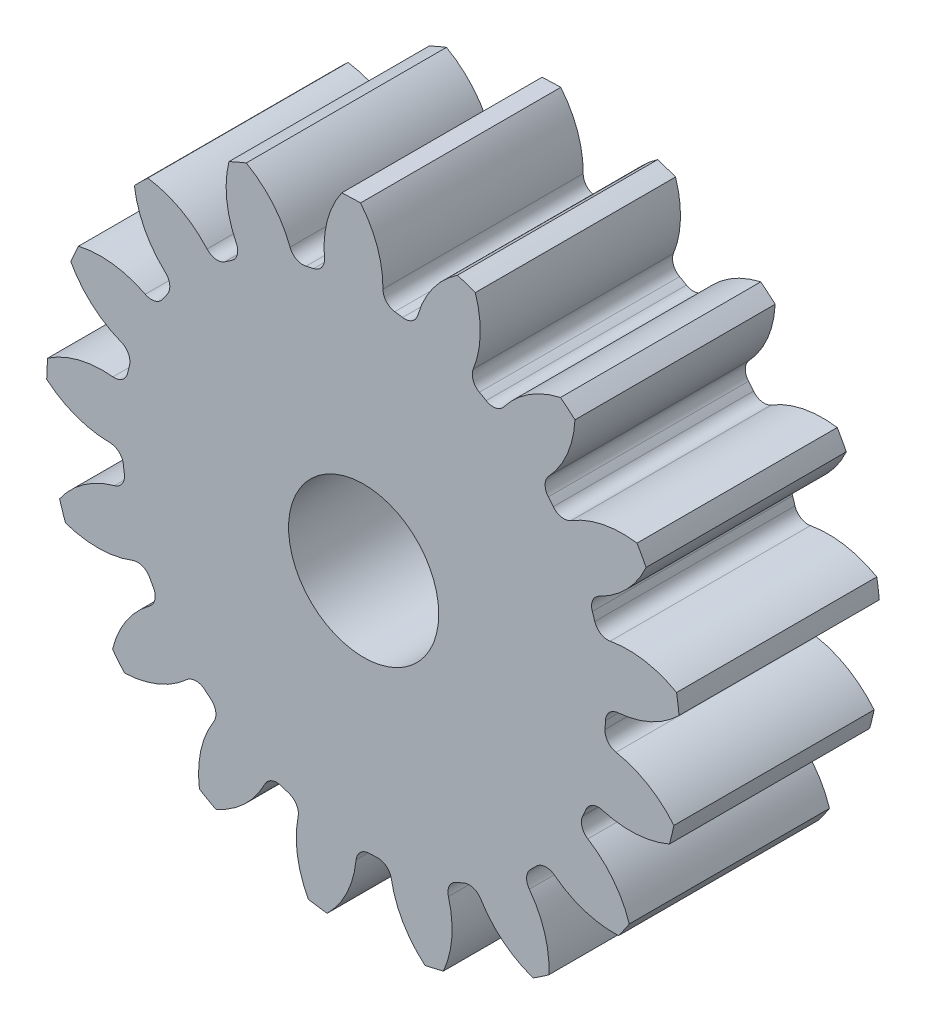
from build123d import *

# Parameters (mm, degrees)
SKETCH3_R         = 160.866666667
GEARBODY_DEPTH    = 101.6
TOOTHCUT_DEPTH    = 250.156033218
CIRPATTERN1_COUNT = 17
BOREDIA_R         = 38.1
BORE_DEPTH        = 12700


with BuildPart() as part:
    # Sketch3 → gearBody (new body)
    with BuildSketch(Plane.XY):
        Circle(SKETCH3_R)
    extrude(amount=GEARBODY_DEPTH)

    # Sketch2 → toothCut (cut, through all)
    with BuildSketch(Plane.XY):
        with BuildLine():
            ThreePointArc((122.473455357, -8.479809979), (122.595234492, -6.485593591), (122.684544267, -4.489659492))
            ThreePointArc((122.684544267, -4.489659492), (124.590330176, 0.020944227), (129.010831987, 2.127298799))
            ThreePointArc((129.010831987, 2.127298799), (146.323124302, 6.778463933), (160.866666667, 17.258644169))
            ThreePointArc((160.866666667, 17.258644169), (161.563893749, -8.547132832), (158.147798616, -34.135304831))
            ThreePointArc((158.147798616, -34.135304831), (144.791194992, -22.179137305), (128.066278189, -15.727318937))
            ThreePointArc((128.066278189, -15.727318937), (123.892691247, -13.166315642), (122.473455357, -8.479809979))
        make_face()
    toothcut = extrude(amount=TOOTHCUT_DEPTH, mode=Mode.SUBTRACT)

    # CirPattern1: toothCut ×17 about axis
    cirpattern1_axis = Axis((0, 0, 0), (0, 0, 1))
    for i in range(1, CIRPATTERN1_COUNT):
        add(toothcut.rotate(cirpattern1_axis, i * 360 / CIRPATTERN1_COUNT), mode=Mode.SUBTRACT)

    # boreDia → bore (cut, symmetric)
    with BuildSketch(Plane.XY):
        Circle(BOREDIA_R)
    extrude(amount=BORE_DEPTH, both=True, mode=Mode.SUBTRACT)


solid = part.part
